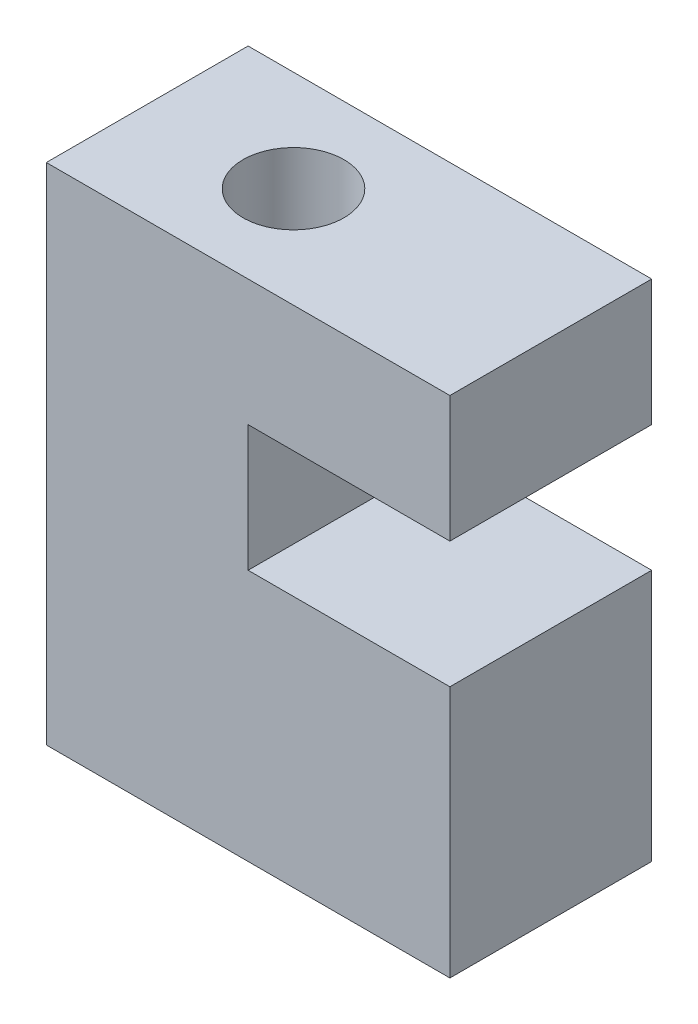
ISO-10303-21;
HEADER;
FILE_DESCRIPTION(('STEP AP214'),'2;1');
FILE_NAME('part.step','',(''),(''),'','','');
FILE_SCHEMA(('AUTOMOTIVE_DESIGN { 1 0 10303 214 1 1 1 1 }'));
ENDSEC;
DATA;
#1=APPLICATION_CONTEXT('core data for automotive mechanical design processes');
#2=APPLICATION_PROTOCOL_DEFINITION('international standard','automotive_design',2000,#1);
#3=PRODUCT_CONTEXT('',#1,'mechanical');
#4=PRODUCT('Part','Part','',(#3));
#5=PRODUCT_RELATED_PRODUCT_CATEGORY('part','',(#4));
#6=PRODUCT_DEFINITION_FORMATION('','',#4);
#7=PRODUCT_DEFINITION_CONTEXT('part definition',#1,'design');
#8=PRODUCT_DEFINITION('design','',#6,#7);
#9=PRODUCT_DEFINITION_SHAPE('','',#8);
#10=(LENGTH_UNIT() NAMED_UNIT(*) SI_UNIT(.MILLI.,.METRE.));
#11=(NAMED_UNIT(*) PLANE_ANGLE_UNIT() SI_UNIT($,.RADIAN.));
#12=(NAMED_UNIT(*) SI_UNIT($,.STERADIAN.) SOLID_ANGLE_UNIT());
#13=UNCERTAINTY_MEASURE_WITH_UNIT(LENGTH_MEASURE(1.E-05),#10,'distance_accuracy_value','');
#14=(GEOMETRIC_REPRESENTATION_CONTEXT(3) GLOBAL_UNCERTAINTY_ASSIGNED_CONTEXT((#13)) GLOBAL_UNIT_ASSIGNED_CONTEXT((#10,
#11,#12)) REPRESENTATION_CONTEXT('',''));
#15=CARTESIAN_POINT('',(0.,0.,0.));
#16=DIRECTION('',(0.,0.,1.));
#17=DIRECTION('',(1.,0.,0.));
#18=AXIS2_PLACEMENT_3D('',#15,#16,#17);
#19=CARTESIAN_POINT('',(0.,100.,20.));
#20=DIRECTION('',(1.,0.,0.));
#21=DIRECTION('',(0.,0.,-1.));
#22=AXIS2_PLACEMENT_3D('',#19,#20,#21);
#23=PLANE('',#22);
#24=DIRECTION('',(0.,-1.,0.));
#25=VECTOR('',#24,1.);
#26=CARTESIAN_POINT('',(0.,100.,-20.));
#27=LINE('',#26,#25);
#28=CARTESIAN_POINT('',(0.,100.,-20.));
#29=VERTEX_POINT('',#28);
#30=CARTESIAN_POINT('',(0.,0.,-20.));
#31=VERTEX_POINT('',#30);
#32=EDGE_CURVE('E99',#29,#31,#27,.T.);
#33=ORIENTED_EDGE('',*,*,#32,.T.);
#34=DIRECTION('',(0.,0.,-1.));
#35=VECTOR('',#34,1.);
#36=CARTESIAN_POINT('',(0.,0.,20.));
#37=LINE('',#36,#35);
#38=CARTESIAN_POINT('',(0.,0.,20.));
#39=VERTEX_POINT('',#38);
#40=EDGE_CURVE('E11',#39,#31,#37,.T.);
#41=ORIENTED_EDGE('',*,*,#40,.F.);
#42=DIRECTION('',(0.,-1.,0.));
#43=VECTOR('',#42,1.);
#44=CARTESIAN_POINT('',(0.,100.,20.));
#45=LINE('',#44,#43);
#46=CARTESIAN_POINT('',(0.,100.,20.));
#47=VERTEX_POINT('',#46);
#48=EDGE_CURVE('E131',#47,#39,#45,.T.);
#49=ORIENTED_EDGE('',*,*,#48,.F.);
#50=DIRECTION('',(0.,0.,-1.));
#51=VECTOR('',#50,1.);
#52=CARTESIAN_POINT('',(0.,100.,20.));
#53=LINE('',#52,#51);
#54=EDGE_CURVE('E112',#47,#29,#53,.T.);
#55=ORIENTED_EDGE('',*,*,#54,.T.);
#56=EDGE_LOOP('',(#33,#41,#49,#55));
#57=FACE_BOUND('',#56,.T.);
#58=ADVANCED_FACE('F31',(#57),#23,.F.);
#59=CARTESIAN_POINT('',(0.,0.,20.));
#60=DIRECTION('',(0.,1.,0.));
#61=DIRECTION('',(0.,0.,1.));
#62=AXIS2_PLACEMENT_3D('',#59,#60,#61);
#63=PLANE('',#62);
#64=CARTESIAN_POINT('',(29.,0.,0.));
#65=DIRECTION('',(0.,1.,0.));
#66=DIRECTION('',(-1.,0.,0.));
#67=AXIS2_PLACEMENT_3D('',#64,#65,#66);
#68=CIRCLE('',#67,10.);
#69=CARTESIAN_POINT('',(19.,0.,0.));
#70=VERTEX_POINT('',#69);
#71=EDGE_CURVE('E113',#70,#70,#68,.T.);
#72=ORIENTED_EDGE('',*,*,#71,.T.);
#73=EDGE_LOOP('',(#72));
#74=FACE_BOUND('',#73,.T.);
#75=DIRECTION('',(1.,0.,0.));
#76=VECTOR('',#75,1.);
#77=CARTESIAN_POINT('',(0.,0.,-20.));
#78=LINE('',#77,#76);
#79=CARTESIAN_POINT('',(80.,0.,-20.));
#80=VERTEX_POINT('',#79);
#81=EDGE_CURVE('E95',#31,#80,#78,.T.);
#82=ORIENTED_EDGE('',*,*,#81,.T.);
#83=DIRECTION('',(0.,0.,-1.));
#84=VECTOR('',#83,1.);
#85=CARTESIAN_POINT('',(80.,0.,20.));
#86=LINE('',#85,#84);
#87=CARTESIAN_POINT('',(80.,0.,20.));
#88=VERTEX_POINT('',#87);
#89=EDGE_CURVE('E38',#88,#80,#86,.T.);
#90=ORIENTED_EDGE('',*,*,#89,.F.);
#91=DIRECTION('',(1.,0.,0.));
#92=VECTOR('',#91,1.);
#93=CARTESIAN_POINT('',(0.,0.,20.));
#94=LINE('',#93,#92);
#95=EDGE_CURVE('E108',#39,#88,#94,.T.);
#96=ORIENTED_EDGE('',*,*,#95,.F.);
#97=ORIENTED_EDGE('',*,*,#40,.T.);
#98=EDGE_LOOP('',(#82,#90,#96,#97));
#99=FACE_BOUND('',#98,.T.);
#100=ADVANCED_FACE('F107',(#74,#99),#63,.F.);
#101=CARTESIAN_POINT('',(80.,0.,20.));
#102=DIRECTION('',(-1.,0.,0.));
#103=DIRECTION('',(0.,0.,1.));
#104=AXIS2_PLACEMENT_3D('',#101,#102,#103);
#105=PLANE('',#104);
#106=DIRECTION('',(0.,1.,0.));
#107=VECTOR('',#106,1.);
#108=CARTESIAN_POINT('',(80.,0.,-20.));
#109=LINE('',#108,#107);
#110=CARTESIAN_POINT('',(80.,50.,-20.));
#111=VERTEX_POINT('',#110);
#112=EDGE_CURVE('E101',#80,#111,#109,.T.);
#113=ORIENTED_EDGE('',*,*,#112,.T.);
#114=DIRECTION('',(0.,0.,-1.));
#115=VECTOR('',#114,1.);
#116=CARTESIAN_POINT('',(80.,50.,20.));
#117=LINE('',#116,#115);
#118=CARTESIAN_POINT('',(80.,50.,20.));
#119=VERTEX_POINT('',#118);
#120=EDGE_CURVE('E157',#119,#111,#117,.T.);
#121=ORIENTED_EDGE('',*,*,#120,.F.);
#122=DIRECTION('',(0.,1.,0.));
#123=VECTOR('',#122,1.);
#124=CARTESIAN_POINT('',(80.,0.,20.));
#125=LINE('',#124,#123);
#126=EDGE_CURVE('E134',#88,#119,#125,.T.);
#127=ORIENTED_EDGE('',*,*,#126,.F.);
#128=ORIENTED_EDGE('',*,*,#89,.T.);
#129=EDGE_LOOP('',(#113,#121,#127,#128));
#130=FACE_BOUND('',#129,.T.);
#131=ADVANCED_FACE('F161',(#130),#105,.F.);
#132=CARTESIAN_POINT('',(80.,50.,20.));
#133=DIRECTION('',(0.,-1.,0.));
#134=DIRECTION('',(1.,0.,0.));
#135=AXIS2_PLACEMENT_3D('',#132,#133,#134);
#136=PLANE('',#135);
#137=DIRECTION('',(-1.,0.,0.));
#138=VECTOR('',#137,1.);
#139=CARTESIAN_POINT('',(80.,50.,-20.));
#140=LINE('',#139,#138);
#141=CARTESIAN_POINT('',(40.,50.,-20.));
#142=VERTEX_POINT('',#141);
#143=EDGE_CURVE('E121',#111,#142,#140,.T.);
#144=ORIENTED_EDGE('',*,*,#143,.T.);
#145=DIRECTION('',(0.,0.,-1.));
#146=VECTOR('',#145,1.);
#147=CARTESIAN_POINT('',(40.,50.,20.));
#148=LINE('',#147,#146);
#149=CARTESIAN_POINT('',(40.,50.,20.));
#150=VERTEX_POINT('',#149);
#151=EDGE_CURVE('E154',#150,#142,#148,.T.);
#152=ORIENTED_EDGE('',*,*,#151,.F.);
#153=DIRECTION('',(-1.,0.,0.));
#154=VECTOR('',#153,1.);
#155=CARTESIAN_POINT('',(80.,50.,20.));
#156=LINE('',#155,#154);
#157=EDGE_CURVE('E136',#119,#150,#156,.T.);
#158=ORIENTED_EDGE('',*,*,#157,.F.);
#159=ORIENTED_EDGE('',*,*,#120,.T.);
#160=EDGE_LOOP('',(#144,#152,#158,#159));
#161=FACE_BOUND('',#160,.T.);
#162=ADVANCED_FACE('F169',(#161),#136,.F.);
#163=CARTESIAN_POINT('',(40.,50.,20.));
#164=DIRECTION('',(-1.,0.,0.));
#165=DIRECTION('',(0.,0.,1.));
#166=AXIS2_PLACEMENT_3D('',#163,#164,#165);
#167=PLANE('',#166);
#168=DIRECTION('',(0.,1.,0.));
#169=VECTOR('',#168,1.);
#170=CARTESIAN_POINT('',(40.,50.,-20.));
#171=LINE('',#170,#169);
#172=CARTESIAN_POINT('',(40.,75.,-20.));
#173=VERTEX_POINT('',#172);
#174=EDGE_CURVE('E123',#142,#173,#171,.T.);
#175=ORIENTED_EDGE('',*,*,#174,.T.);
#176=DIRECTION('',(0.,0.,-1.));
#177=VECTOR('',#176,1.);
#178=CARTESIAN_POINT('',(40.,75.,20.));
#179=LINE('',#178,#177);
#180=CARTESIAN_POINT('',(40.,75.,20.));
#181=VERTEX_POINT('',#180);
#182=EDGE_CURVE('E151',#181,#173,#179,.T.);
#183=ORIENTED_EDGE('',*,*,#182,.F.);
#184=DIRECTION('',(0.,1.,0.));
#185=VECTOR('',#184,1.);
#186=CARTESIAN_POINT('',(40.,50.,20.));
#187=LINE('',#186,#185);
#188=EDGE_CURVE('E138',#150,#181,#187,.T.);
#189=ORIENTED_EDGE('',*,*,#188,.F.);
#190=ORIENTED_EDGE('',*,*,#151,.T.);
#191=EDGE_LOOP('',(#175,#183,#189,#190));
#192=FACE_BOUND('',#191,.T.);
#193=ADVANCED_FACE('F172',(#192),#167,.F.);
#194=CARTESIAN_POINT('',(40.,75.,20.));
#195=DIRECTION('',(0.,1.,0.));
#196=DIRECTION('',(0.,0.,1.));
#197=AXIS2_PLACEMENT_3D('',#194,#195,#196);
#198=PLANE('',#197);
#199=DIRECTION('',(1.,0.,0.));
#200=VECTOR('',#199,1.);
#201=CARTESIAN_POINT('',(40.,75.,-20.));
#202=LINE('',#201,#200);
#203=CARTESIAN_POINT('',(80.,75.,-20.));
#204=VERTEX_POINT('',#203);
#205=EDGE_CURVE('E125',#173,#204,#202,.T.);
#206=ORIENTED_EDGE('',*,*,#205,.T.);
#207=DIRECTION('',(0.,0.,-1.));
#208=VECTOR('',#207,1.);
#209=CARTESIAN_POINT('',(80.,75.,20.));
#210=LINE('',#209,#208);
#211=CARTESIAN_POINT('',(80.,75.,20.));
#212=VERTEX_POINT('',#211);
#213=EDGE_CURVE('E148',#212,#204,#210,.T.);
#214=ORIENTED_EDGE('',*,*,#213,.F.);
#215=DIRECTION('',(1.,0.,0.));
#216=VECTOR('',#215,1.);
#217=CARTESIAN_POINT('',(40.,75.,20.));
#218=LINE('',#217,#216);
#219=EDGE_CURVE('E140',#181,#212,#218,.T.);
#220=ORIENTED_EDGE('',*,*,#219,.F.);
#221=ORIENTED_EDGE('',*,*,#182,.T.);
#222=EDGE_LOOP('',(#206,#214,#220,#221));
#223=FACE_BOUND('',#222,.T.);
#224=ADVANCED_FACE('F177',(#223),#198,.F.);
#225=CARTESIAN_POINT('',(80.,75.,20.));
#226=DIRECTION('',(-1.,0.,0.));
#227=DIRECTION('',(0.,0.,1.));
#228=AXIS2_PLACEMENT_3D('',#225,#226,#227);
#229=PLANE('',#228);
#230=DIRECTION('',(0.,1.,0.));
#231=VECTOR('',#230,1.);
#232=CARTESIAN_POINT('',(80.,75.,-20.));
#233=LINE('',#232,#231);
#234=CARTESIAN_POINT('',(80.,100.,-20.));
#235=VERTEX_POINT('',#234);
#236=EDGE_CURVE('E127',#204,#235,#233,.T.);
#237=ORIENTED_EDGE('',*,*,#236,.T.);
#238=DIRECTION('',(0.,0.,-1.));
#239=VECTOR('',#238,1.);
#240=CARTESIAN_POINT('',(80.,100.,20.));
#241=LINE('',#240,#239);
#242=CARTESIAN_POINT('',(80.,100.,20.));
#243=VERTEX_POINT('',#242);
#244=EDGE_CURVE('E145',#243,#235,#241,.T.);
#245=ORIENTED_EDGE('',*,*,#244,.F.);
#246=DIRECTION('',(0.,1.,0.));
#247=VECTOR('',#246,1.);
#248=CARTESIAN_POINT('',(80.,75.,20.));
#249=LINE('',#248,#247);
#250=EDGE_CURVE('E50',#212,#243,#249,.T.);
#251=ORIENTED_EDGE('',*,*,#250,.F.);
#252=ORIENTED_EDGE('',*,*,#213,.T.);
#253=EDGE_LOOP('',(#237,#245,#251,#252));
#254=FACE_BOUND('',#253,.T.);
#255=ADVANCED_FACE('F180',(#254),#229,.F.);
#256=CARTESIAN_POINT('',(80.,100.,20.));
#257=DIRECTION('',(0.,-1.,0.));
#258=DIRECTION('',(1.,0.,0.));
#259=AXIS2_PLACEMENT_3D('',#256,#257,#258);
#260=PLANE('',#259);
#261=CARTESIAN_POINT('',(29.,100.,0.));
#262=DIRECTION('',(0.,1.,0.));
#263=DIRECTION('',(-1.,0.,0.));
#264=AXIS2_PLACEMENT_3D('',#261,#262,#263);
#265=CIRCLE('',#264,10.);
#266=CARTESIAN_POINT('',(19.,100.,0.));
#267=VERTEX_POINT('',#266);
#268=EDGE_CURVE('E116',#267,#267,#265,.T.);
#269=ORIENTED_EDGE('',*,*,#268,.F.);
#270=EDGE_LOOP('',(#269));
#271=FACE_BOUND('',#270,.T.);
#272=DIRECTION('',(-1.,0.,0.));
#273=VECTOR('',#272,1.);
#274=CARTESIAN_POINT('',(80.,100.,-20.));
#275=LINE('',#274,#273);
#276=EDGE_CURVE('E129',#235,#29,#275,.T.);
#277=ORIENTED_EDGE('',*,*,#276,.T.);
#278=ORIENTED_EDGE('',*,*,#54,.F.);
#279=DIRECTION('',(-1.,0.,0.));
#280=VECTOR('',#279,1.);
#281=CARTESIAN_POINT('',(80.,100.,20.));
#282=LINE('',#281,#280);
#283=EDGE_CURVE('E45',#243,#47,#282,.T.);
#284=ORIENTED_EDGE('',*,*,#283,.F.);
#285=ORIENTED_EDGE('',*,*,#244,.T.);
#286=EDGE_LOOP('',(#277,#278,#284,#285));
#287=FACE_BOUND('',#286,.T.);
#288=ADVANCED_FACE('F182',(#271,#287),#260,.F.);
#289=CARTESIAN_POINT('',(0.,0.,20.));
#290=DIRECTION('',(0.,0.,1.));
#291=DIRECTION('',(1.,0.,0.));
#292=AXIS2_PLACEMENT_3D('',#289,#290,#291);
#293=PLANE('',#292);
#294=ORIENTED_EDGE('',*,*,#48,.T.);
#295=ORIENTED_EDGE('',*,*,#95,.T.);
#296=ORIENTED_EDGE('',*,*,#126,.T.);
#297=ORIENTED_EDGE('',*,*,#157,.T.);
#298=ORIENTED_EDGE('',*,*,#188,.T.);
#299=ORIENTED_EDGE('',*,*,#219,.T.);
#300=ORIENTED_EDGE('',*,*,#250,.T.);
#301=ORIENTED_EDGE('',*,*,#283,.T.);
#302=EDGE_LOOP('',(#294,#295,#296,#297,#298,#299,#300,#301));
#303=FACE_BOUND('',#302,.T.);
#304=ADVANCED_FACE('F164',(#303),#293,.T.);
#305=CARTESIAN_POINT('',(0.,0.,-20.));
#306=DIRECTION('',(0.,0.,1.));
#307=DIRECTION('',(1.,0.,0.));
#308=AXIS2_PLACEMENT_3D('',#305,#306,#307);
#309=PLANE('',#308);
#310=ORIENTED_EDGE('',*,*,#32,.F.);
#311=ORIENTED_EDGE('',*,*,#276,.F.);
#312=ORIENTED_EDGE('',*,*,#236,.F.);
#313=ORIENTED_EDGE('',*,*,#205,.F.);
#314=ORIENTED_EDGE('',*,*,#174,.F.);
#315=ORIENTED_EDGE('',*,*,#143,.F.);
#316=ORIENTED_EDGE('',*,*,#112,.F.);
#317=ORIENTED_EDGE('',*,*,#81,.F.);
#318=EDGE_LOOP('',(#310,#311,#312,#313,#314,#315,#316,#317));
#319=FACE_BOUND('',#318,.T.);
#320=ADVANCED_FACE('F96',(#319),#309,.F.);
#321=CARTESIAN_POINT('',(29.,0.,0.));
#322=DIRECTION('',(0.,1.,0.));
#323=DIRECTION('',(-1.,0.,0.));
#324=AXIS2_PLACEMENT_3D('',#321,#322,#323);
#325=CYLINDRICAL_SURFACE('',#324,10.);
#326=ORIENTED_EDGE('',*,*,#71,.F.);
#327=EDGE_LOOP('',(#326));
#328=FACE_BOUND('',#327,.T.);
#329=ORIENTED_EDGE('',*,*,#268,.T.);
#330=EDGE_LOOP('',(#329));
#331=FACE_BOUND('',#330,.T.);
#332=ADVANCED_FACE('F226',(#328,#331),#325,.F.);
#333=CLOSED_SHELL('',(#58,#100,#131,#162,#193,#224,#255,#288,#304,#320,#332));
#334=MANIFOLD_SOLID_BREP('B2',#333);
#335=ADVANCED_BREP_SHAPE_REPRESENTATION('',(#18,#334),#14);
#336=SHAPE_DEFINITION_REPRESENTATION(#9,#335);
ENDSEC;
END-ISO-10303-21;
